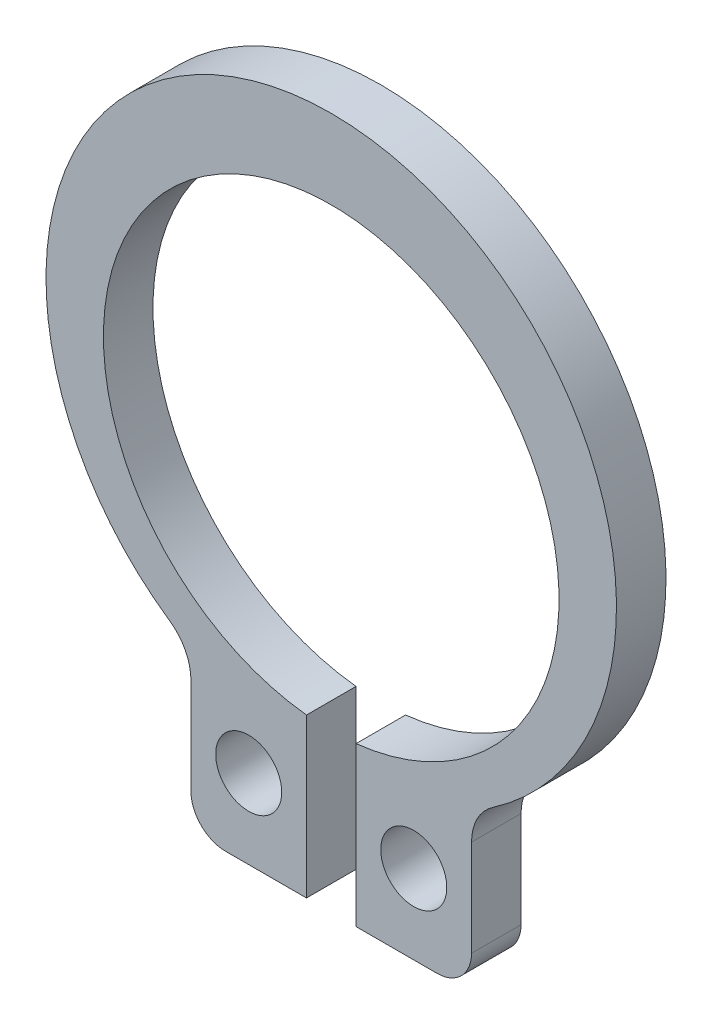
ISO-10303-21;
HEADER;
FILE_DESCRIPTION(('STEP AP214'),'2;1');
FILE_NAME('part.step','',(''),(''),'','','');
FILE_SCHEMA(('AUTOMOTIVE_DESIGN { 1 0 10303 214 1 1 1 1 }'));
ENDSEC;
DATA;
#1=APPLICATION_CONTEXT('core data for automotive mechanical design processes');
#2=APPLICATION_PROTOCOL_DEFINITION('international standard','automotive_design',2000,#1);
#3=PRODUCT_CONTEXT('',#1,'mechanical');
#4=PRODUCT('Part','Part','',(#3));
#5=PRODUCT_RELATED_PRODUCT_CATEGORY('part','',(#4));
#6=PRODUCT_DEFINITION_FORMATION('','',#4);
#7=PRODUCT_DEFINITION_CONTEXT('part definition',#1,'design');
#8=PRODUCT_DEFINITION('design','',#6,#7);
#9=PRODUCT_DEFINITION_SHAPE('','',#8);
#10=(LENGTH_UNIT() NAMED_UNIT(*) SI_UNIT(.MILLI.,.METRE.));
#11=(NAMED_UNIT(*) PLANE_ANGLE_UNIT() SI_UNIT($,.RADIAN.));
#12=(NAMED_UNIT(*) SI_UNIT($,.STERADIAN.) SOLID_ANGLE_UNIT());
#13=UNCERTAINTY_MEASURE_WITH_UNIT(LENGTH_MEASURE(1.E-05),#10,'distance_accuracy_value','');
#14=(GEOMETRIC_REPRESENTATION_CONTEXT(3) GLOBAL_UNCERTAINTY_ASSIGNED_CONTEXT((#13)) GLOBAL_UNIT_ASSIGNED_CONTEXT((#10,
#11,#12)) REPRESENTATION_CONTEXT('',''));
#15=CARTESIAN_POINT('',(0.,0.,0.));
#16=DIRECTION('',(0.,0.,1.));
#17=DIRECTION('',(1.,0.,0.));
#18=AXIS2_PLACEMENT_3D('',#15,#16,#17);
#19=CARTESIAN_POINT('',(0.,0.,1.5));
#20=DIRECTION('',(0.,0.,1.));
#21=DIRECTION('',(1.,0.,0.));
#22=AXIS2_PLACEMENT_3D('',#19,#20,#21);
#23=PLANE('',#22);
#24=CARTESIAN_POINT('',(-2.5,-9.26077889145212,1.5));
#25=DIRECTION('',(0.,0.,1.));
#26=DIRECTION('',(1.,0.,0.));
#27=AXIS2_PLACEMENT_3D('',#24,#25,#26);
#28=CIRCLE('',#27,1.);
#29=CARTESIAN_POINT('',(-1.5,-9.26077889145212,1.5));
#30=VERTEX_POINT('',#29);
#31=EDGE_CURVE('E222',#30,#30,#28,.T.);
#32=ORIENTED_EDGE('',*,*,#31,.F.);
#33=EDGE_LOOP('',(#32));
#34=FACE_BOUND('',#33,.T.);
#35=DIRECTION('',(1.,0.,0.));
#36=VECTOR('',#35,1.);
#37=CARTESIAN_POINT('',(0.750000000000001,-11.6591180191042,1.5));
#38=LINE('',#37,#36);
#39=CARTESIAN_POINT('',(0.750000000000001,-11.6591180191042,1.5));
#40=VERTEX_POINT('',#39);
#41=CARTESIAN_POINT('',(3.2,-11.6591180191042,1.5));
#42=VERTEX_POINT('',#41);
#43=EDGE_CURVE('E138',#40,#42,#38,.T.);
#44=ORIENTED_EDGE('',*,*,#43,.T.);
#45=CARTESIAN_POINT('',(3.2,-10.6091180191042,1.5));
#46=DIRECTION('',(0.,0.,1.));
#47=DIRECTION('',(1.,0.,0.));
#48=AXIS2_PLACEMENT_3D('',#45,#46,#47);
#49=CIRCLE('',#48,1.05);
#50=CARTESIAN_POINT('',(4.25,-10.6091180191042,1.5));
#51=VERTEX_POINT('',#50);
#52=EDGE_CURVE('E188',#42,#51,#49,.T.);
#53=ORIENTED_EDGE('',*,*,#52,.T.);
#54=DIRECTION('',(0.,1.,0.));
#55=VECTOR('',#54,1.);
#56=CARTESIAN_POINT('',(4.25,-11.6591180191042,1.5));
#57=LINE('',#56,#55);
#58=CARTESIAN_POINT('',(4.25,-7.69207159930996,1.5));
#59=VERTEX_POINT('',#58);
#60=EDGE_CURVE('E242',#51,#59,#57,.T.);
#61=ORIENTED_EDGE('',*,*,#60,.T.);
#62=CARTESIAN_POINT('',(5.75,-7.69207159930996,1.5));
#63=DIRECTION('',(0.,0.,1.));
#64=DIRECTION('',(1.,0.,0.));
#65=AXIS2_PLACEMENT_3D('',#62,#63,#64);
#66=CIRCLE('',#65,1.5);
#67=CARTESIAN_POINT('',(4.89940828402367,-6.45655804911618,1.5));
#68=VERTEX_POINT('',#67);
#69=EDGE_CURVE('E172',#59,#68,#66,.F.);
#70=ORIENTED_EDGE('',*,*,#69,.T.);
#71=CARTESIAN_POINT('',(0.,0.66,1.5));
#72=DIRECTION('',(0.,0.,1.));
#73=DIRECTION('',(1.,0.,0.));
#74=AXIS2_PLACEMENT_3D('',#71,#72,#73);
#75=CIRCLE('',#74,8.64);
#76=CARTESIAN_POINT('',(-4.89940828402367,-6.45655804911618,1.5));
#77=VERTEX_POINT('',#76);
#78=EDGE_CURVE('E240',#68,#77,#75,.T.);
#79=ORIENTED_EDGE('',*,*,#78,.T.);
#80=CARTESIAN_POINT('',(-5.75,-7.69207159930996,1.5));
#81=DIRECTION('',(0.,0.,1.));
#82=DIRECTION('',(1.,0.,0.));
#83=AXIS2_PLACEMENT_3D('',#80,#81,#82);
#84=CIRCLE('',#83,1.5);
#85=CARTESIAN_POINT('',(-4.25,-7.69207159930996,1.5));
#86=VERTEX_POINT('',#85);
#87=EDGE_CURVE('E176',#77,#86,#84,.F.);
#88=ORIENTED_EDGE('',*,*,#87,.T.);
#89=DIRECTION('',(0.,-1.,0.));
#90=VECTOR('',#89,1.);
#91=CARTESIAN_POINT('',(-4.25,-11.6591180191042,1.5));
#92=LINE('',#91,#90);
#93=CARTESIAN_POINT('',(-4.25,-10.6091180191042,1.5));
#94=VERTEX_POINT('',#93);
#95=EDGE_CURVE('E216',#86,#94,#92,.T.);
#96=ORIENTED_EDGE('',*,*,#95,.T.);
#97=CARTESIAN_POINT('',(-3.2,-10.6091180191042,1.5));
#98=DIRECTION('',(0.,0.,1.));
#99=DIRECTION('',(1.,0.,0.));
#100=AXIS2_PLACEMENT_3D('',#97,#98,#99);
#101=CIRCLE('',#100,1.05);
#102=CARTESIAN_POINT('',(-3.2,-11.6591180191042,1.5));
#103=VERTEX_POINT('',#102);
#104=EDGE_CURVE('E54',#94,#103,#101,.T.);
#105=ORIENTED_EDGE('',*,*,#104,.T.);
#106=DIRECTION('',(1.,0.,0.));
#107=VECTOR('',#106,1.);
#108=CARTESIAN_POINT('',(-0.749999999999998,-11.6591180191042,1.5));
#109=LINE('',#108,#107);
#110=CARTESIAN_POINT('',(-0.749999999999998,-11.6591180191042,1.5));
#111=VERTEX_POINT('',#110);
#112=EDGE_CURVE('E197',#103,#111,#109,.T.);
#113=ORIENTED_EDGE('',*,*,#112,.T.);
#114=DIRECTION('',(0.,1.,0.));
#115=VECTOR('',#114,1.);
#116=CARTESIAN_POINT('',(-0.749999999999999,-6.85911801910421,1.5));
#117=LINE('',#116,#115);
#118=CARTESIAN_POINT('',(-0.749999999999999,-6.85911801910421,1.5));
#119=VERTEX_POINT('',#118);
#120=EDGE_CURVE('E144',#111,#119,#117,.T.);
#121=ORIENTED_EDGE('',*,*,#120,.T.);
#122=CARTESIAN_POINT('',(0.,0.,1.5));
#123=DIRECTION('',(0.,0.,-1.));
#124=DIRECTION('',(1.,0.,0.));
#125=AXIS2_PLACEMENT_3D('',#122,#123,#124);
#126=CIRCLE('',#125,6.9);
#127=CARTESIAN_POINT('',(0.750000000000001,-6.85911801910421,1.5));
#128=VERTEX_POINT('',#127);
#129=EDGE_CURVE('E139',#119,#128,#126,.T.);
#130=ORIENTED_EDGE('',*,*,#129,.T.);
#131=DIRECTION('',(0.,-1.,0.));
#132=VECTOR('',#131,1.);
#133=CARTESIAN_POINT('',(0.750000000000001,-6.85911801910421,1.5));
#134=LINE('',#133,#132);
#135=EDGE_CURVE('E128',#128,#40,#134,.T.);
#136=ORIENTED_EDGE('',*,*,#135,.T.);
#137=EDGE_LOOP('',(#44,#53,#61,#70,#79,#88,#96,#105,#113,#121,#130,#136));
#138=FACE_BOUND('',#137,.T.);
#139=CARTESIAN_POINT('',(2.5,-9.26077889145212,1.5));
#140=DIRECTION('',(0.,0.,1.));
#141=DIRECTION('',(-1.,0.,0.));
#142=AXIS2_PLACEMENT_3D('',#139,#140,#141);
#143=CIRCLE('',#142,1.);
#144=CARTESIAN_POINT('',(1.5,-9.26077889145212,1.5));
#145=VERTEX_POINT('',#144);
#146=EDGE_CURVE('E250',#145,#145,#143,.T.);
#147=ORIENTED_EDGE('',*,*,#146,.F.);
#148=EDGE_LOOP('',(#147));
#149=FACE_BOUND('',#148,.T.);
#150=ADVANCED_FACE('F39',(#34,#138,#149),#23,.T.);
#151=CARTESIAN_POINT('',(0.,0.,0.));
#152=DIRECTION('',(0.,0.,1.));
#153=DIRECTION('',(1.,0.,0.));
#154=AXIS2_PLACEMENT_3D('',#151,#152,#153);
#155=PLANE('',#154);
#156=DIRECTION('',(0.,1.,0.));
#157=VECTOR('',#156,1.);
#158=CARTESIAN_POINT('',(4.25,-11.6591180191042,0.));
#159=LINE('',#158,#157);
#160=CARTESIAN_POINT('',(4.25,-10.6091180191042,0.));
#161=VERTEX_POINT('',#160);
#162=CARTESIAN_POINT('',(4.25,-7.69207159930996,0.));
#163=VERTEX_POINT('',#162);
#164=EDGE_CURVE('E227',#161,#163,#159,.T.);
#165=ORIENTED_EDGE('',*,*,#164,.F.);
#166=CARTESIAN_POINT('',(3.2,-10.6091180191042,0.));
#167=DIRECTION('',(0.,0.,1.));
#168=DIRECTION('',(1.,0.,0.));
#169=AXIS2_PLACEMENT_3D('',#166,#167,#168);
#170=CIRCLE('',#169,1.05);
#171=CARTESIAN_POINT('',(3.2,-11.6591180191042,0.));
#172=VERTEX_POINT('',#171);
#173=EDGE_CURVE('E183',#161,#172,#170,.F.);
#174=ORIENTED_EDGE('',*,*,#173,.T.);
#175=DIRECTION('',(1.,0.,0.));
#176=VECTOR('',#175,1.);
#177=CARTESIAN_POINT('',(0.750000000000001,-11.6591180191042,0.));
#178=LINE('',#177,#176);
#179=CARTESIAN_POINT('',(0.750000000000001,-11.6591180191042,0.));
#180=VERTEX_POINT('',#179);
#181=EDGE_CURVE('E224',#180,#172,#178,.T.);
#182=ORIENTED_EDGE('',*,*,#181,.F.);
#183=DIRECTION('',(0.,-1.,0.));
#184=VECTOR('',#183,1.);
#185=CARTESIAN_POINT('',(0.750000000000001,-6.85911801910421,0.));
#186=LINE('',#185,#184);
#187=CARTESIAN_POINT('',(0.750000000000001,-6.85911801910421,0.));
#188=VERTEX_POINT('',#187);
#189=EDGE_CURVE('E221',#188,#180,#186,.T.);
#190=ORIENTED_EDGE('',*,*,#189,.F.);
#191=CARTESIAN_POINT('',(0.,0.,0.));
#192=DIRECTION('',(0.,0.,-1.));
#193=DIRECTION('',(1.,0.,0.));
#194=AXIS2_PLACEMENT_3D('',#191,#192,#193);
#195=CIRCLE('',#194,6.9);
#196=CARTESIAN_POINT('',(-0.749999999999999,-6.85911801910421,0.));
#197=VERTEX_POINT('',#196);
#198=EDGE_CURVE('E152',#197,#188,#195,.T.);
#199=ORIENTED_EDGE('',*,*,#198,.F.);
#200=DIRECTION('',(0.,1.,0.));
#201=VECTOR('',#200,1.);
#202=CARTESIAN_POINT('',(-0.749999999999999,-6.85911801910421,0.));
#203=LINE('',#202,#201);
#204=CARTESIAN_POINT('',(-0.749999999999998,-11.6591180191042,0.));
#205=VERTEX_POINT('',#204);
#206=EDGE_CURVE('E148',#205,#197,#203,.T.);
#207=ORIENTED_EDGE('',*,*,#206,.F.);
#208=DIRECTION('',(1.,0.,0.));
#209=VECTOR('',#208,1.);
#210=CARTESIAN_POINT('',(-0.749999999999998,-11.6591180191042,0.));
#211=LINE('',#210,#209);
#212=CARTESIAN_POINT('',(-3.2,-11.6591180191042,0.));
#213=VERTEX_POINT('',#212);
#214=EDGE_CURVE('E195',#213,#205,#211,.T.);
#215=ORIENTED_EDGE('',*,*,#214,.F.);
#216=CARTESIAN_POINT('',(-3.2,-10.6091180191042,0.));
#217=DIRECTION('',(0.,0.,1.));
#218=DIRECTION('',(1.,0.,0.));
#219=AXIS2_PLACEMENT_3D('',#216,#217,#218);
#220=CIRCLE('',#219,1.05);
#221=CARTESIAN_POINT('',(-4.25,-10.6091180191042,0.));
#222=VERTEX_POINT('',#221);
#223=EDGE_CURVE('E181',#213,#222,#220,.F.);
#224=ORIENTED_EDGE('',*,*,#223,.T.);
#225=DIRECTION('',(0.,-1.,0.));
#226=VECTOR('',#225,1.);
#227=CARTESIAN_POINT('',(-4.25,-11.6591180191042,0.));
#228=LINE('',#227,#226);
#229=CARTESIAN_POINT('',(-4.25,-7.69207159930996,0.));
#230=VERTEX_POINT('',#229);
#231=EDGE_CURVE('E205',#230,#222,#228,.T.);
#232=ORIENTED_EDGE('',*,*,#231,.F.);
#233=CARTESIAN_POINT('',(-5.75,-7.69207159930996,0.));
#234=DIRECTION('',(0.,0.,1.));
#235=DIRECTION('',(1.,0.,0.));
#236=AXIS2_PLACEMENT_3D('',#233,#234,#235);
#237=CIRCLE('',#236,1.5);
#238=CARTESIAN_POINT('',(-4.89940828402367,-6.45655804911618,0.));
#239=VERTEX_POINT('',#238);
#240=EDGE_CURVE('E174',#230,#239,#237,.T.);
#241=ORIENTED_EDGE('',*,*,#240,.T.);
#242=CARTESIAN_POINT('',(0.,0.66,0.));
#243=DIRECTION('',(0.,0.,1.));
#244=DIRECTION('',(1.,0.,0.));
#245=AXIS2_PLACEMENT_3D('',#242,#243,#244);
#246=CIRCLE('',#245,8.64);
#247=CARTESIAN_POINT('',(4.89940828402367,-6.45655804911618,0.));
#248=VERTEX_POINT('',#247);
#249=EDGE_CURVE('E208',#248,#239,#246,.T.);
#250=ORIENTED_EDGE('',*,*,#249,.F.);
#251=CARTESIAN_POINT('',(5.75,-7.69207159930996,0.));
#252=DIRECTION('',(0.,0.,1.));
#253=DIRECTION('',(1.,0.,0.));
#254=AXIS2_PLACEMENT_3D('',#251,#252,#253);
#255=CIRCLE('',#254,1.5);
#256=EDGE_CURVE('E169',#248,#163,#255,.T.);
#257=ORIENTED_EDGE('',*,*,#256,.T.);
#258=EDGE_LOOP('',(#165,#174,#182,#190,#199,#207,#215,#224,#232,#241,#250,#257));
#259=FACE_BOUND('',#258,.T.);
#260=CARTESIAN_POINT('',(-2.5,-9.26077889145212,0.));
#261=DIRECTION('',(0.,0.,1.));
#262=DIRECTION('',(1.,0.,0.));
#263=AXIS2_PLACEMENT_3D('',#260,#261,#262);
#264=CIRCLE('',#263,1.);
#265=CARTESIAN_POINT('',(-1.5,-9.26077889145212,0.));
#266=VERTEX_POINT('',#265);
#267=EDGE_CURVE('E247',#266,#266,#264,.T.);
#268=ORIENTED_EDGE('',*,*,#267,.T.);
#269=EDGE_LOOP('',(#268));
#270=FACE_BOUND('',#269,.T.);
#271=CARTESIAN_POINT('',(2.5,-9.26077889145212,0.));
#272=DIRECTION('',(0.,0.,1.));
#273=DIRECTION('',(-1.,0.,0.));
#274=AXIS2_PLACEMENT_3D('',#271,#272,#273);
#275=CIRCLE('',#274,1.);
#276=CARTESIAN_POINT('',(1.5,-9.26077889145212,0.));
#277=VERTEX_POINT('',#276);
#278=EDGE_CURVE('E253',#277,#277,#275,.T.);
#279=ORIENTED_EDGE('',*,*,#278,.T.);
#280=EDGE_LOOP('',(#279));
#281=FACE_BOUND('',#280,.T.);
#282=ADVANCED_FACE('F202',(#259,#270,#281),#155,.F.);
#283=CARTESIAN_POINT('',(0.,0.,1.5));
#284=DIRECTION('',(0.,0.,-1.));
#285=DIRECTION('',(-1.,0.,0.));
#286=AXIS2_PLACEMENT_3D('',#283,#284,#285);
#287=CYLINDRICAL_SURFACE('',#286,6.9);
#288=ORIENTED_EDGE('',*,*,#198,.T.);
#289=DIRECTION('',(0.,0.,-1.));
#290=VECTOR('',#289,1.);
#291=CARTESIAN_POINT('',(0.750000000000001,-6.85911801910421,1.5));
#292=LINE('',#291,#290);
#293=EDGE_CURVE('E132',#128,#188,#292,.T.);
#294=ORIENTED_EDGE('',*,*,#293,.F.);
#295=ORIENTED_EDGE('',*,*,#129,.F.);
#296=DIRECTION('',(0.,0.,-1.));
#297=VECTOR('',#296,1.);
#298=CARTESIAN_POINT('',(-0.749999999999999,-6.85911801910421,1.5));
#299=LINE('',#298,#297);
#300=EDGE_CURVE('E212',#119,#197,#299,.T.);
#301=ORIENTED_EDGE('',*,*,#300,.T.);
#302=EDGE_LOOP('',(#288,#294,#295,#301));
#303=FACE_BOUND('',#302,.T.);
#304=ADVANCED_FACE('F150',(#303),#287,.F.);
#305=CARTESIAN_POINT('',(0.750000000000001,-6.85911801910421,1.5));
#306=DIRECTION('',(1.,0.,0.));
#307=DIRECTION('',(0.,1.,0.));
#308=AXIS2_PLACEMENT_3D('',#305,#306,#307);
#309=PLANE('',#308);
#310=ORIENTED_EDGE('',*,*,#189,.T.);
#311=DIRECTION('',(0.,0.,-1.));
#312=VECTOR('',#311,1.);
#313=CARTESIAN_POINT('',(0.750000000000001,-11.6591180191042,1.5));
#314=LINE('',#313,#312);
#315=EDGE_CURVE('E135',#40,#180,#314,.T.);
#316=ORIENTED_EDGE('',*,*,#315,.F.);
#317=ORIENTED_EDGE('',*,*,#135,.F.);
#318=ORIENTED_EDGE('',*,*,#293,.T.);
#319=EDGE_LOOP('',(#310,#316,#317,#318));
#320=FACE_BOUND('',#319,.T.);
#321=ADVANCED_FACE('F130',(#320),#309,.F.);
#322=CARTESIAN_POINT('',(0.750000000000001,-11.6591180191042,1.5));
#323=DIRECTION('',(0.,1.,0.));
#324=DIRECTION('',(-1.,0.,0.));
#325=AXIS2_PLACEMENT_3D('',#322,#323,#324);
#326=PLANE('',#325);
#327=ORIENTED_EDGE('',*,*,#181,.T.);
#328=DIRECTION('',(0.,0.,-1.));
#329=VECTOR('',#328,1.);
#330=CARTESIAN_POINT('',(3.2,-11.6591180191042,1.5));
#331=LINE('',#330,#329);
#332=EDGE_CURVE('E185',#172,#42,#331,.F.);
#333=ORIENTED_EDGE('',*,*,#332,.T.);
#334=ORIENTED_EDGE('',*,*,#43,.F.);
#335=ORIENTED_EDGE('',*,*,#315,.T.);
#336=EDGE_LOOP('',(#327,#333,#334,#335));
#337=FACE_BOUND('',#336,.T.);
#338=ADVANCED_FACE('F285',(#337),#326,.F.);
#339=CARTESIAN_POINT('',(4.25,-11.6591180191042,1.5));
#340=DIRECTION('',(-1.,0.,0.));
#341=DIRECTION('',(0.,0.,1.));
#342=AXIS2_PLACEMENT_3D('',#339,#340,#341);
#343=PLANE('',#342);
#344=ORIENTED_EDGE('',*,*,#60,.F.);
#345=DIRECTION('',(0.,0.,-1.));
#346=VECTOR('',#345,1.);
#347=CARTESIAN_POINT('',(4.25,-10.6091180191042,1.5));
#348=LINE('',#347,#346);
#349=EDGE_CURVE('E178',#51,#161,#348,.T.);
#350=ORIENTED_EDGE('',*,*,#349,.T.);
#351=ORIENTED_EDGE('',*,*,#164,.T.);
#352=DIRECTION('',(0.,0.,1.));
#353=VECTOR('',#352,1.);
#354=CARTESIAN_POINT('',(4.25,-7.69207159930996,1.5));
#355=LINE('',#354,#353);
#356=EDGE_CURVE('E163',#163,#59,#355,.T.);
#357=ORIENTED_EDGE('',*,*,#356,.T.);
#358=EDGE_LOOP('',(#344,#350,#351,#357));
#359=FACE_BOUND('',#358,.T.);
#360=ADVANCED_FACE('F282',(#359),#343,.F.);
#361=CARTESIAN_POINT('',(0.,0.66,1.5));
#362=DIRECTION('',(0.,0.,-1.));
#363=DIRECTION('',(-1.,0.,0.));
#364=AXIS2_PLACEMENT_3D('',#361,#362,#363);
#365=CYLINDRICAL_SURFACE('',#364,8.64);
#366=ORIENTED_EDGE('',*,*,#78,.F.);
#367=DIRECTION('',(0.,0.,-1.));
#368=VECTOR('',#367,1.);
#369=CARTESIAN_POINT('',(4.89940828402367,-6.45655804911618,1.5));
#370=LINE('',#369,#368);
#371=EDGE_CURVE('E155',#68,#248,#370,.T.);
#372=ORIENTED_EDGE('',*,*,#371,.T.);
#373=ORIENTED_EDGE('',*,*,#249,.T.);
#374=DIRECTION('',(0.,0.,-1.));
#375=VECTOR('',#374,1.);
#376=CARTESIAN_POINT('',(-4.89940828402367,-6.45655804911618,1.5));
#377=LINE('',#376,#375);
#378=EDGE_CURVE('E153',#239,#77,#377,.F.);
#379=ORIENTED_EDGE('',*,*,#378,.T.);
#380=EDGE_LOOP('',(#366,#372,#373,#379));
#381=FACE_BOUND('',#380,.T.);
#382=ADVANCED_FACE('F233',(#381),#365,.T.);
#383=CARTESIAN_POINT('',(-4.25,-11.6591180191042,1.5));
#384=DIRECTION('',(1.,0.,0.));
#385=DIRECTION('',(0.,0.,-1.));
#386=AXIS2_PLACEMENT_3D('',#383,#384,#385);
#387=PLANE('',#386);
#388=ORIENTED_EDGE('',*,*,#231,.T.);
#389=DIRECTION('',(0.,0.,-1.));
#390=VECTOR('',#389,1.);
#391=CARTESIAN_POINT('',(-4.25,-10.6091180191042,1.5));
#392=LINE('',#391,#390);
#393=EDGE_CURVE('E11',#222,#94,#392,.F.);
#394=ORIENTED_EDGE('',*,*,#393,.T.);
#395=ORIENTED_EDGE('',*,*,#95,.F.);
#396=DIRECTION('',(0.,0.,1.));
#397=VECTOR('',#396,1.);
#398=CARTESIAN_POINT('',(-4.25,-7.69207159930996,0.));
#399=LINE('',#398,#397);
#400=EDGE_CURVE('E166',#86,#230,#399,.F.);
#401=ORIENTED_EDGE('',*,*,#400,.T.);
#402=EDGE_LOOP('',(#388,#394,#395,#401));
#403=FACE_BOUND('',#402,.T.);
#404=ADVANCED_FACE('F241',(#403),#387,.F.);
#405=CARTESIAN_POINT('',(-0.749999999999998,-11.6591180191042,1.5));
#406=DIRECTION('',(0.,1.,0.));
#407=DIRECTION('',(0.,0.,1.));
#408=AXIS2_PLACEMENT_3D('',#405,#406,#407);
#409=PLANE('',#408);
#410=ORIENTED_EDGE('',*,*,#112,.F.);
#411=DIRECTION('',(0.,0.,-1.));
#412=VECTOR('',#411,1.);
#413=CARTESIAN_POINT('',(-3.2,-11.6591180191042,1.5));
#414=LINE('',#413,#412);
#415=EDGE_CURVE('E47',#103,#213,#414,.T.);
#416=ORIENTED_EDGE('',*,*,#415,.T.);
#417=ORIENTED_EDGE('',*,*,#214,.T.);
#418=DIRECTION('',(0.,0.,-1.));
#419=VECTOR('',#418,1.);
#420=CARTESIAN_POINT('',(-0.749999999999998,-11.6591180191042,1.5));
#421=LINE('',#420,#419);
#422=EDGE_CURVE('E157',#111,#205,#421,.T.);
#423=ORIENTED_EDGE('',*,*,#422,.F.);
#424=EDGE_LOOP('',(#410,#416,#417,#423));
#425=FACE_BOUND('',#424,.T.);
#426=ADVANCED_FACE('F193',(#425),#409,.F.);
#427=CARTESIAN_POINT('',(-0.749999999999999,-6.85911801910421,1.5));
#428=DIRECTION('',(-1.,0.,0.));
#429=DIRECTION('',(0.,-1.,0.));
#430=AXIS2_PLACEMENT_3D('',#427,#428,#429);
#431=PLANE('',#430);
#432=ORIENTED_EDGE('',*,*,#206,.T.);
#433=ORIENTED_EDGE('',*,*,#300,.F.);
#434=ORIENTED_EDGE('',*,*,#120,.F.);
#435=ORIENTED_EDGE('',*,*,#422,.T.);
#436=EDGE_LOOP('',(#432,#433,#434,#435));
#437=FACE_BOUND('',#436,.T.);
#438=ADVANCED_FACE('F214',(#437),#431,.F.);
#439=CARTESIAN_POINT('',(-2.5,-9.26077889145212,1.5));
#440=DIRECTION('',(0.,0.,-1.));
#441=DIRECTION('',(-1.,0.,0.));
#442=AXIS2_PLACEMENT_3D('',#439,#440,#441);
#443=CYLINDRICAL_SURFACE('',#442,1.);
#444=ORIENTED_EDGE('',*,*,#31,.T.);
#445=EDGE_LOOP('',(#444));
#446=FACE_BOUND('',#445,.T.);
#447=ORIENTED_EDGE('',*,*,#267,.F.);
#448=EDGE_LOOP('',(#447));
#449=FACE_BOUND('',#448,.T.);
#450=ADVANCED_FACE('F271',(#446,#449),#443,.F.);
#451=CARTESIAN_POINT('',(2.5,-9.26077889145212,1.5));
#452=DIRECTION('',(0.,0.,-1.));
#453=DIRECTION('',(-1.,0.,0.));
#454=AXIS2_PLACEMENT_3D('',#451,#452,#453);
#455=CYLINDRICAL_SURFACE('',#454,1.);
#456=ORIENTED_EDGE('',*,*,#146,.T.);
#457=EDGE_LOOP('',(#456));
#458=FACE_BOUND('',#457,.T.);
#459=ORIENTED_EDGE('',*,*,#278,.F.);
#460=EDGE_LOOP('',(#459));
#461=FACE_BOUND('',#460,.T.);
#462=ADVANCED_FACE('F259',(#458,#461),#455,.F.);
#463=CARTESIAN_POINT('',(5.75,-7.69207159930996,1.5));
#464=DIRECTION('',(0.,0.,-1.));
#465=DIRECTION('',(-1.,0.,0.));
#466=AXIS2_PLACEMENT_3D('',#463,#464,#465);
#467=CYLINDRICAL_SURFACE('',#466,1.5);
#468=ORIENTED_EDGE('',*,*,#69,.F.);
#469=ORIENTED_EDGE('',*,*,#356,.F.);
#470=ORIENTED_EDGE('',*,*,#256,.F.);
#471=ORIENTED_EDGE('',*,*,#371,.F.);
#472=EDGE_LOOP('',(#468,#469,#470,#471));
#473=FACE_BOUND('',#472,.T.);
#474=ADVANCED_FACE('F294',(#473),#467,.F.);
#475=CARTESIAN_POINT('',(-5.75,-7.69207159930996,1.5));
#476=DIRECTION('',(0.,0.,-1.));
#477=DIRECTION('',(-1.,0.,0.));
#478=AXIS2_PLACEMENT_3D('',#475,#476,#477);
#479=CYLINDRICAL_SURFACE('',#478,1.5);
#480=ORIENTED_EDGE('',*,*,#87,.F.);
#481=ORIENTED_EDGE('',*,*,#378,.F.);
#482=ORIENTED_EDGE('',*,*,#240,.F.);
#483=ORIENTED_EDGE('',*,*,#400,.F.);
#484=EDGE_LOOP('',(#480,#481,#482,#483));
#485=FACE_BOUND('',#484,.T.);
#486=ADVANCED_FACE('F238',(#485),#479,.F.);
#487=CARTESIAN_POINT('',(3.2,-10.6091180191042,1.5));
#488=DIRECTION('',(0.,0.,-1.));
#489=DIRECTION('',(-1.,0.,0.));
#490=AXIS2_PLACEMENT_3D('',#487,#488,#489);
#491=CYLINDRICAL_SURFACE('',#490,1.05);
#492=ORIENTED_EDGE('',*,*,#52,.F.);
#493=ORIENTED_EDGE('',*,*,#332,.F.);
#494=ORIENTED_EDGE('',*,*,#173,.F.);
#495=ORIENTED_EDGE('',*,*,#349,.F.);
#496=EDGE_LOOP('',(#492,#493,#494,#495));
#497=FACE_BOUND('',#496,.T.);
#498=ADVANCED_FACE('F298',(#497),#491,.T.);
#499=CARTESIAN_POINT('',(-3.2,-10.6091180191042,1.5));
#500=DIRECTION('',(0.,0.,-1.));
#501=DIRECTION('',(-1.,0.,0.));
#502=AXIS2_PLACEMENT_3D('',#499,#500,#501);
#503=CYLINDRICAL_SURFACE('',#502,1.05);
#504=ORIENTED_EDGE('',*,*,#104,.F.);
#505=ORIENTED_EDGE('',*,*,#393,.F.);
#506=ORIENTED_EDGE('',*,*,#223,.F.);
#507=ORIENTED_EDGE('',*,*,#415,.F.);
#508=EDGE_LOOP('',(#504,#505,#506,#507));
#509=FACE_BOUND('',#508,.T.);
#510=ADVANCED_FACE('F41',(#509),#503,.T.);
#511=CLOSED_SHELL('',(#150,#282,#304,#321,#338,#360,#382,#404,#426,#438,#450,#462,#474,#486,
#498,#510));
#512=MANIFOLD_SOLID_BREP('B2',#511);
#513=ADVANCED_BREP_SHAPE_REPRESENTATION('',(#18,#512),#14);
#514=SHAPE_DEFINITION_REPRESENTATION(#9,#513);
ENDSEC;
END-ISO-10303-21;
